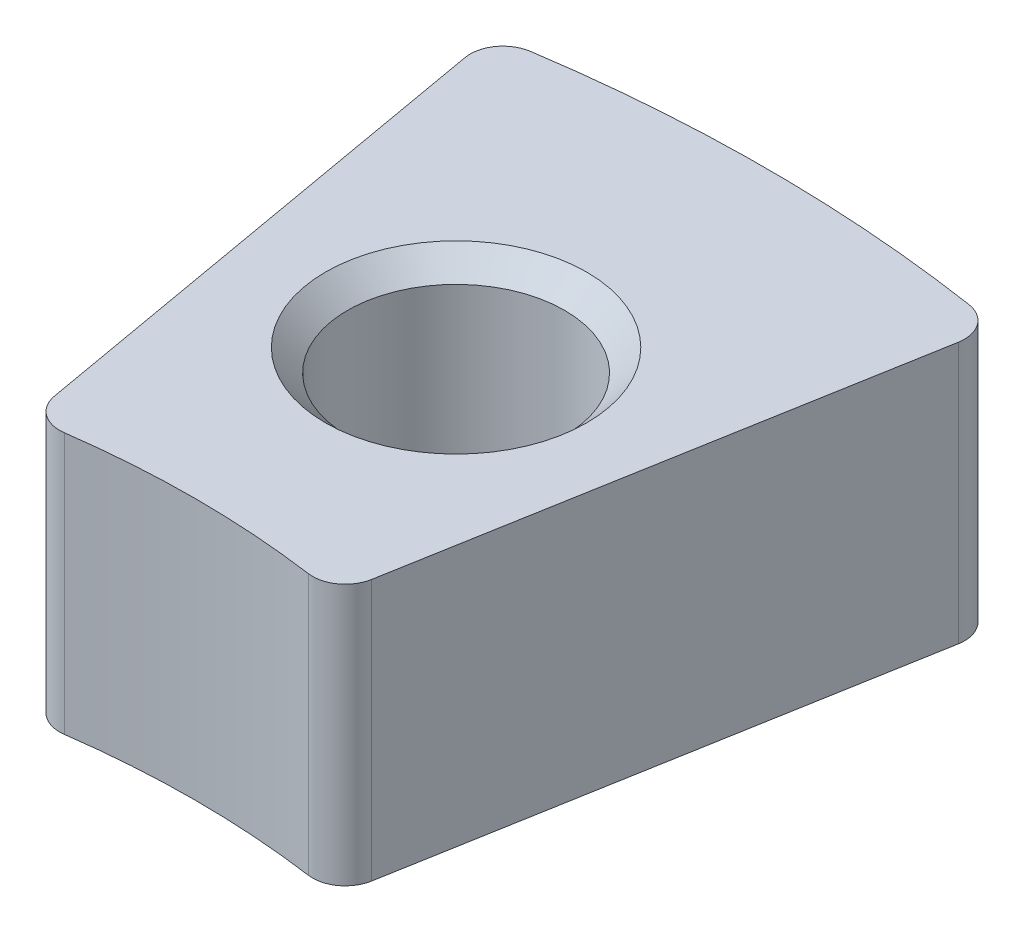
ISO-10303-21;
HEADER;
FILE_DESCRIPTION(('STEP AP214'),'2;1');
FILE_NAME('part.step','',(''),(''),'','','');
FILE_SCHEMA(('AUTOMOTIVE_DESIGN { 1 0 10303 214 1 1 1 1 }'));
ENDSEC;
DATA;
#1=APPLICATION_CONTEXT('core data for automotive mechanical design processes');
#2=APPLICATION_PROTOCOL_DEFINITION('international standard','automotive_design',2000,#1);
#3=PRODUCT_CONTEXT('',#1,'mechanical');
#4=PRODUCT('Part','Part','',(#3));
#5=PRODUCT_RELATED_PRODUCT_CATEGORY('part','',(#4));
#6=PRODUCT_DEFINITION_FORMATION('','',#4);
#7=PRODUCT_DEFINITION_CONTEXT('part definition',#1,'design');
#8=PRODUCT_DEFINITION('design','',#6,#7);
#9=PRODUCT_DEFINITION_SHAPE('','',#8);
#10=(LENGTH_UNIT() NAMED_UNIT(*) SI_UNIT(.MILLI.,.METRE.));
#11=(NAMED_UNIT(*) PLANE_ANGLE_UNIT() SI_UNIT($,.RADIAN.));
#12=(NAMED_UNIT(*) SI_UNIT($,.STERADIAN.) SOLID_ANGLE_UNIT());
#13=UNCERTAINTY_MEASURE_WITH_UNIT(LENGTH_MEASURE(1.E-05),#10,'distance_accuracy_value','');
#14=(GEOMETRIC_REPRESENTATION_CONTEXT(3) GLOBAL_UNCERTAINTY_ASSIGNED_CONTEXT((#13)) GLOBAL_UNIT_ASSIGNED_CONTEXT((#10,
#11,#12)) REPRESENTATION_CONTEXT('',''));
#15=CARTESIAN_POINT('',(0.,0.,0.));
#16=DIRECTION('',(0.,0.,1.));
#17=DIRECTION('',(1.,0.,0.));
#18=AXIS2_PLACEMENT_3D('',#15,#16,#17);
#19=CARTESIAN_POINT('',(0.,8.,34.9999999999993));
#20=DIRECTION('',(0.,1.,0.));
#21=DIRECTION('',(0.,0.,1.));
#22=AXIS2_PLACEMENT_3D('',#19,#20,#21);
#23=PLANE('',#22);
#24=CARTESIAN_POINT('',(0.,8.,34.9999999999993));
#25=DIRECTION('',(0.,1.,0.));
#26=DIRECTION('',(0.,0.,1.));
#27=AXIS2_PLACEMENT_3D('',#24,#25,#26);
#28=CIRCLE('',#27,44.4999999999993);
#29=CARTESIAN_POINT('',(6.7178547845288,8.,-8.9900037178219));
#30=VERTEX_POINT('',#29);
#31=CARTESIAN_POINT('',(-6.7178547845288,8.,-8.9900037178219));
#32=VERTEX_POINT('',#31);
#33=EDGE_CURVE('E143',#30,#32,#28,.T.);
#34=ORIENTED_EDGE('',*,*,#33,.T.);
#35=CARTESIAN_POINT('',(-6.56689175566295,8.,-8.00146430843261));
#36=DIRECTION('',(0.,1.,0.));
#37=DIRECTION('',(0.,0.,1.));
#38=AXIS2_PLACEMENT_3D('',#35,#36,#37);
#39=CIRCLE('',#38,1.00000000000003);
#40=CARTESIAN_POINT('',(-7.5516995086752,8.,-7.8278161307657));
#41=VERTEX_POINT('',#40);
#42=EDGE_CURVE('E91',#32,#41,#39,.T.);
#43=ORIENTED_EDGE('',*,*,#42,.T.);
#44=DIRECTION('',(0.173648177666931,0.,0.984807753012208));
#45=VECTOR('',#44,1.);
#46=CARTESIAN_POINT('',(-7.5516995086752,8.,-7.8278161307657));
#47=LINE('',#46,#45);
#48=CARTESIAN_POINT('',(-4.8590471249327,8.,7.4429743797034));
#49=VERTEX_POINT('',#48);
#50=EDGE_CURVE('E158',#41,#49,#47,.T.);
#51=ORIENTED_EDGE('',*,*,#50,.T.);
#52=CARTESIAN_POINT('',(-3.87423937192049,8.,7.26932620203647));
#53=DIRECTION('',(0.,1.,0.));
#54=DIRECTION('',(0.,0.,1.));
#55=AXIS2_PLACEMENT_3D('',#52,#53,#54);
#56=CIRCLE('',#55,1.);
#57=CARTESIAN_POINT('',(-3.7358736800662,8.,8.2597074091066));
#58=VERTEX_POINT('',#57);
#59=EDGE_CURVE('E171',#49,#58,#56,.T.);
#60=ORIENTED_EDGE('',*,*,#59,.T.);
#61=CARTESIAN_POINT('',(0.,8.,34.9999999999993));
#62=DIRECTION('',(0.,-1.,0.));
#63=DIRECTION('',(0.,0.,-1.));
#64=AXIS2_PLACEMENT_3D('',#61,#62,#63);
#65=CIRCLE('',#64,26.9999999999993);
#66=CARTESIAN_POINT('',(3.7358736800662,8.,8.2597074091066));
#67=VERTEX_POINT('',#66);
#68=EDGE_CURVE('E110',#58,#67,#65,.T.);
#69=ORIENTED_EDGE('',*,*,#68,.T.);
#70=CARTESIAN_POINT('',(3.87423937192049,8.,7.26932620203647));
#71=DIRECTION('',(0.,1.,0.));
#72=DIRECTION('',(0.,0.,1.));
#73=AXIS2_PLACEMENT_3D('',#70,#71,#72);
#74=CIRCLE('',#73,1.);
#75=CARTESIAN_POINT('',(4.8590471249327,8.,7.4429743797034));
#76=VERTEX_POINT('',#75);
#77=EDGE_CURVE('E104',#67,#76,#74,.T.);
#78=ORIENTED_EDGE('',*,*,#77,.T.);
#79=DIRECTION('',(0.173648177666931,0.,-0.984807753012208));
#80=VECTOR('',#79,1.);
#81=CARTESIAN_POINT('',(4.8590471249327,8.,7.4429743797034));
#82=LINE('',#81,#80);
#83=CARTESIAN_POINT('',(7.5516995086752,8.,-7.8278161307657));
#84=VERTEX_POINT('',#83);
#85=EDGE_CURVE('E108',#76,#84,#82,.T.);
#86=ORIENTED_EDGE('',*,*,#85,.T.);
#87=CARTESIAN_POINT('',(6.56689175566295,8.,-8.00146430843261));
#88=DIRECTION('',(0.,1.,0.));
#89=DIRECTION('',(0.,0.,1.));
#90=AXIS2_PLACEMENT_3D('',#87,#88,#89);
#91=CIRCLE('',#90,1.00000000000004);
#92=EDGE_CURVE('E48',#84,#30,#91,.T.);
#93=ORIENTED_EDGE('',*,*,#92,.T.);
#94=EDGE_LOOP('',(#34,#43,#51,#60,#69,#78,#86,#93));
#95=FACE_BOUND('',#94,.T.);
#96=CARTESIAN_POINT('',(0.,8.,0.));
#97=DIRECTION('',(0.,1.,0.));
#98=DIRECTION('',(0.,0.,1.));
#99=AXIS2_PLACEMENT_3D('',#96,#97,#98);
#100=CIRCLE('',#99,4.);
#101=CARTESIAN_POINT('',(0.,8.,4.));
#102=VERTEX_POINT('',#101);
#103=EDGE_CURVE('E132',#102,#102,#100,.T.);
#104=ORIENTED_EDGE('',*,*,#103,.F.);
#105=EDGE_LOOP('',(#104));
#106=FACE_BOUND('',#105,.T.);
#107=ADVANCED_FACE('F31',(#95,#106),#23,.T.);
#108=CARTESIAN_POINT('',(0.,0.,34.9999999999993));
#109=DIRECTION('',(0.,1.,0.));
#110=DIRECTION('',(0.,0.,1.));
#111=AXIS2_PLACEMENT_3D('',#108,#109,#110);
#112=PLANE('',#111);
#113=CARTESIAN_POINT('',(0.,0.,34.9999999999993));
#114=DIRECTION('',(0.,1.,0.));
#115=DIRECTION('',(0.,0.,1.));
#116=AXIS2_PLACEMENT_3D('',#113,#114,#115);
#117=CIRCLE('',#116,44.4999999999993);
#118=CARTESIAN_POINT('',(6.7178547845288,0.,-8.9900037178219));
#119=VERTEX_POINT('',#118);
#120=CARTESIAN_POINT('',(-6.7178547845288,0.,-8.9900037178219));
#121=VERTEX_POINT('',#120);
#122=EDGE_CURVE('E128',#119,#121,#117,.T.);
#123=ORIENTED_EDGE('',*,*,#122,.F.);
#124=CARTESIAN_POINT('',(6.56689175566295,0.,-8.00146430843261));
#125=DIRECTION('',(0.,1.,0.));
#126=DIRECTION('',(0.,0.,1.));
#127=AXIS2_PLACEMENT_3D('',#124,#125,#126);
#128=CIRCLE('',#127,1.00000000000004);
#129=CARTESIAN_POINT('',(7.5516995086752,0.,-7.8278161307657));
#130=VERTEX_POINT('',#129);
#131=EDGE_CURVE('E83',#130,#119,#128,.T.);
#132=ORIENTED_EDGE('',*,*,#131,.F.);
#133=DIRECTION('',(0.173648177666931,0.,-0.984807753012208));
#134=VECTOR('',#133,1.);
#135=CARTESIAN_POINT('',(4.8590471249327,0.,7.4429743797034));
#136=LINE('',#135,#134);
#137=CARTESIAN_POINT('',(4.8590471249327,0.,7.4429743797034));
#138=VERTEX_POINT('',#137);
#139=EDGE_CURVE('E77',#138,#130,#136,.T.);
#140=ORIENTED_EDGE('',*,*,#139,.F.);
#141=CARTESIAN_POINT('',(3.87423937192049,0.,7.26932620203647));
#142=DIRECTION('',(0.,1.,0.));
#143=DIRECTION('',(0.,0.,1.));
#144=AXIS2_PLACEMENT_3D('',#141,#142,#143);
#145=CIRCLE('',#144,1.);
#146=CARTESIAN_POINT('',(3.7358736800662,0.,8.2597074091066));
#147=VERTEX_POINT('',#146);
#148=EDGE_CURVE('E118',#147,#138,#145,.T.);
#149=ORIENTED_EDGE('',*,*,#148,.F.);
#150=CARTESIAN_POINT('',(0.,0.,34.9999999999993));
#151=DIRECTION('',(0.,-1.,0.));
#152=DIRECTION('',(0.,0.,-1.));
#153=AXIS2_PLACEMENT_3D('',#150,#151,#152);
#154=CIRCLE('',#153,26.9999999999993);
#155=CARTESIAN_POINT('',(-3.7358736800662,0.,8.2597074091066));
#156=VERTEX_POINT('',#155);
#157=EDGE_CURVE('E138',#156,#147,#154,.T.);
#158=ORIENTED_EDGE('',*,*,#157,.F.);
#159=CARTESIAN_POINT('',(-3.87423937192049,0.,7.26932620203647));
#160=DIRECTION('',(0.,1.,0.));
#161=DIRECTION('',(0.,0.,1.));
#162=AXIS2_PLACEMENT_3D('',#159,#160,#161);
#163=CIRCLE('',#162,1.);
#164=CARTESIAN_POINT('',(-4.8590471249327,0.,7.4429743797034));
#165=VERTEX_POINT('',#164);
#166=EDGE_CURVE('E136',#165,#156,#163,.T.);
#167=ORIENTED_EDGE('',*,*,#166,.F.);
#168=DIRECTION('',(0.173648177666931,0.,0.984807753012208));
#169=VECTOR('',#168,1.);
#170=CARTESIAN_POINT('',(-7.5516995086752,0.,-7.8278161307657));
#171=LINE('',#170,#169);
#172=CARTESIAN_POINT('',(-7.5516995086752,0.,-7.8278161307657));
#173=VERTEX_POINT('',#172);
#174=EDGE_CURVE('E134',#173,#165,#171,.T.);
#175=ORIENTED_EDGE('',*,*,#174,.F.);
#176=CARTESIAN_POINT('',(-6.56689175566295,0.,-8.00146430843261));
#177=DIRECTION('',(0.,1.,0.));
#178=DIRECTION('',(0.,0.,1.));
#179=AXIS2_PLACEMENT_3D('',#176,#177,#178);
#180=CIRCLE('',#179,1.00000000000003);
#181=EDGE_CURVE('E131',#121,#173,#180,.T.);
#182=ORIENTED_EDGE('',*,*,#181,.F.);
#183=EDGE_LOOP('',(#123,#132,#140,#149,#158,#167,#175,#182));
#184=FACE_BOUND('',#183,.T.);
#185=CARTESIAN_POINT('',(0.,0.,0.));
#186=DIRECTION('',(0.,1.,0.));
#187=DIRECTION('',(0.,0.,1.));
#188=AXIS2_PLACEMENT_3D('',#185,#186,#187);
#189=CIRCLE('',#188,4.);
#190=CARTESIAN_POINT('',(0.,0.,4.));
#191=VERTEX_POINT('',#190);
#192=EDGE_CURVE('E185',#191,#191,#189,.T.);
#193=ORIENTED_EDGE('',*,*,#192,.T.);
#194=EDGE_LOOP('',(#193));
#195=FACE_BOUND('',#194,.T.);
#196=ADVANCED_FACE('F162',(#184,#195),#112,.F.);
#197=CARTESIAN_POINT('',(0.,8.,34.9999999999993));
#198=DIRECTION('',(0.,-1.,0.));
#199=DIRECTION('',(0.,0.,-1.));
#200=AXIS2_PLACEMENT_3D('',#197,#198,#199);
#201=CYLINDRICAL_SURFACE('',#200,44.4999999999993);
#202=ORIENTED_EDGE('',*,*,#122,.T.);
#203=DIRECTION('',(0.,-1.,0.));
#204=VECTOR('',#203,1.);
#205=CARTESIAN_POINT('',(-6.7178547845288,8.,-8.9900037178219));
#206=LINE('',#205,#204);
#207=EDGE_CURVE('E11',#32,#121,#206,.T.);
#208=ORIENTED_EDGE('',*,*,#207,.F.);
#209=ORIENTED_EDGE('',*,*,#33,.F.);
#210=DIRECTION('',(0.,-1.,0.));
#211=VECTOR('',#210,1.);
#212=CARTESIAN_POINT('',(6.7178547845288,8.,-8.9900037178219));
#213=LINE('',#212,#211);
#214=EDGE_CURVE('E124',#30,#119,#213,.T.);
#215=ORIENTED_EDGE('',*,*,#214,.T.);
#216=EDGE_LOOP('',(#202,#208,#209,#215));
#217=FACE_BOUND('',#216,.T.);
#218=ADVANCED_FACE('F33',(#217),#201,.T.);
#219=CARTESIAN_POINT('',(-6.56689175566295,8.,-8.00146430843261));
#220=DIRECTION('',(0.,-1.,0.));
#221=DIRECTION('',(0.,0.,-1.));
#222=AXIS2_PLACEMENT_3D('',#219,#220,#221);
#223=CYLINDRICAL_SURFACE('',#222,1.00000000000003);
#224=ORIENTED_EDGE('',*,*,#181,.T.);
#225=DIRECTION('',(0.,-1.,0.));
#226=VECTOR('',#225,1.);
#227=CARTESIAN_POINT('',(-7.5516995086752,8.,-7.8278161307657));
#228=LINE('',#227,#226);
#229=EDGE_CURVE('E40',#41,#173,#228,.T.);
#230=ORIENTED_EDGE('',*,*,#229,.F.);
#231=ORIENTED_EDGE('',*,*,#42,.F.);
#232=ORIENTED_EDGE('',*,*,#207,.T.);
#233=EDGE_LOOP('',(#224,#230,#231,#232));
#234=FACE_BOUND('',#233,.T.);
#235=ADVANCED_FACE('F220',(#234),#223,.T.);
#236=CARTESIAN_POINT('',(-7.5516995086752,8.,-7.8278161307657));
#237=DIRECTION('',(0.984807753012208,0.,-0.173648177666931));
#238=DIRECTION('',(-0.173648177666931,0.,-0.984807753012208));
#239=AXIS2_PLACEMENT_3D('',#236,#237,#238);
#240=PLANE('',#239);
#241=ORIENTED_EDGE('',*,*,#174,.T.);
#242=DIRECTION('',(0.,-1.,0.));
#243=VECTOR('',#242,1.);
#244=CARTESIAN_POINT('',(-4.8590471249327,8.,7.4429743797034));
#245=LINE('',#244,#243);
#246=EDGE_CURVE('E150',#49,#165,#245,.T.);
#247=ORIENTED_EDGE('',*,*,#246,.F.);
#248=ORIENTED_EDGE('',*,*,#50,.F.);
#249=ORIENTED_EDGE('',*,*,#229,.T.);
#250=EDGE_LOOP('',(#241,#247,#248,#249));
#251=FACE_BOUND('',#250,.T.);
#252=ADVANCED_FACE('F156',(#251),#240,.F.);
#253=CARTESIAN_POINT('',(-3.87423937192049,8.,7.26932620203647));
#254=DIRECTION('',(0.,-1.,0.));
#255=DIRECTION('',(0.,0.,-1.));
#256=AXIS2_PLACEMENT_3D('',#253,#254,#255);
#257=CYLINDRICAL_SURFACE('',#256,1.);
#258=ORIENTED_EDGE('',*,*,#166,.T.);
#259=DIRECTION('',(0.,-1.,0.));
#260=VECTOR('',#259,1.);
#261=CARTESIAN_POINT('',(-3.7358736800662,8.,8.2597074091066));
#262=LINE('',#261,#260);
#263=EDGE_CURVE('E147',#58,#156,#262,.T.);
#264=ORIENTED_EDGE('',*,*,#263,.F.);
#265=ORIENTED_EDGE('',*,*,#59,.F.);
#266=ORIENTED_EDGE('',*,*,#246,.T.);
#267=EDGE_LOOP('',(#258,#264,#265,#266));
#268=FACE_BOUND('',#267,.T.);
#269=ADVANCED_FACE('F167',(#268),#257,.T.);
#270=CARTESIAN_POINT('',(0.,8.,34.9999999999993));
#271=DIRECTION('',(0.,-1.,0.));
#272=DIRECTION('',(0.,0.,-1.));
#273=AXIS2_PLACEMENT_3D('',#270,#271,#272);
#274=CYLINDRICAL_SURFACE('',#273,26.9999999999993);
#275=ORIENTED_EDGE('',*,*,#157,.T.);
#276=DIRECTION('',(0.,-1.,0.));
#277=VECTOR('',#276,1.);
#278=CARTESIAN_POINT('',(3.7358736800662,8.,8.2597074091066));
#279=LINE('',#278,#277);
#280=EDGE_CURVE('E119',#67,#147,#279,.T.);
#281=ORIENTED_EDGE('',*,*,#280,.F.);
#282=ORIENTED_EDGE('',*,*,#68,.F.);
#283=ORIENTED_EDGE('',*,*,#263,.T.);
#284=EDGE_LOOP('',(#275,#281,#282,#283));
#285=FACE_BOUND('',#284,.T.);
#286=ADVANCED_FACE('F170',(#285),#274,.F.);
#287=CARTESIAN_POINT('',(3.87423937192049,8.,7.26932620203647));
#288=DIRECTION('',(0.,-1.,0.));
#289=DIRECTION('',(0.,0.,-1.));
#290=AXIS2_PLACEMENT_3D('',#287,#288,#289);
#291=CYLINDRICAL_SURFACE('',#290,1.);
#292=ORIENTED_EDGE('',*,*,#148,.T.);
#293=DIRECTION('',(0.,-1.,0.));
#294=VECTOR('',#293,1.);
#295=CARTESIAN_POINT('',(4.8590471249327,8.,7.4429743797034));
#296=LINE('',#295,#294);
#297=EDGE_CURVE('E115',#76,#138,#296,.T.);
#298=ORIENTED_EDGE('',*,*,#297,.F.);
#299=ORIENTED_EDGE('',*,*,#77,.F.);
#300=ORIENTED_EDGE('',*,*,#280,.T.);
#301=EDGE_LOOP('',(#292,#298,#299,#300));
#302=FACE_BOUND('',#301,.T.);
#303=ADVANCED_FACE('F116',(#302),#291,.T.);
#304=CARTESIAN_POINT('',(4.8590471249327,8.,7.4429743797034));
#305=DIRECTION('',(-0.984807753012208,0.,-0.173648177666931));
#306=DIRECTION('',(-0.173648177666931,0.,0.984807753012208));
#307=AXIS2_PLACEMENT_3D('',#304,#305,#306);
#308=PLANE('',#307);
#309=ORIENTED_EDGE('',*,*,#139,.T.);
#310=DIRECTION('',(0.,-1.,0.));
#311=VECTOR('',#310,1.);
#312=CARTESIAN_POINT('',(7.5516995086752,8.,-7.8278161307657));
#313=LINE('',#312,#311);
#314=EDGE_CURVE('E120',#84,#130,#313,.T.);
#315=ORIENTED_EDGE('',*,*,#314,.F.);
#316=ORIENTED_EDGE('',*,*,#85,.F.);
#317=ORIENTED_EDGE('',*,*,#297,.T.);
#318=EDGE_LOOP('',(#309,#315,#316,#317));
#319=FACE_BOUND('',#318,.T.);
#320=ADVANCED_FACE('F122',(#319),#308,.F.);
#321=CARTESIAN_POINT('',(6.56689175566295,8.,-8.00146430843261));
#322=DIRECTION('',(0.,-1.,0.));
#323=DIRECTION('',(0.,0.,-1.));
#324=AXIS2_PLACEMENT_3D('',#321,#322,#323);
#325=CYLINDRICAL_SURFACE('',#324,1.00000000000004);
#326=ORIENTED_EDGE('',*,*,#131,.T.);
#327=ORIENTED_EDGE('',*,*,#214,.F.);
#328=ORIENTED_EDGE('',*,*,#92,.F.);
#329=ORIENTED_EDGE('',*,*,#314,.T.);
#330=EDGE_LOOP('',(#326,#327,#328,#329));
#331=FACE_BOUND('',#330,.T.);
#332=ADVANCED_FACE('F208',(#331),#325,.T.);
#333=CARTESIAN_POINT('',(0.,7.3235,0.));
#334=DIRECTION('',(0.,1.,0.));
#335=DIRECTION('',(0.,0.,1.));
#336=AXIS2_PLACEMENT_3D('',#333,#334,#335);
#337=CONICAL_SURFACE('',#336,3.3235,0.785398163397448);
#338=ORIENTED_EDGE('',*,*,#103,.T.);
#339=EDGE_LOOP('',(#338));
#340=FACE_BOUND('',#339,.T.);
#341=CARTESIAN_POINT('',(0.,7.3235,0.));
#342=DIRECTION('',(0.,1.,0.));
#343=DIRECTION('',(0.,0.,1.));
#344=AXIS2_PLACEMENT_3D('',#341,#342,#343);
#345=CIRCLE('',#344,3.3235);
#346=CARTESIAN_POINT('',(0.,7.3235,3.3235));
#347=VERTEX_POINT('',#346);
#348=EDGE_CURVE('E179',#347,#347,#345,.T.);
#349=ORIENTED_EDGE('',*,*,#348,.F.);
#350=EDGE_LOOP('',(#349));
#351=FACE_BOUND('',#350,.T.);
#352=ADVANCED_FACE('F197',(#340,#351),#337,.F.);
#353=CARTESIAN_POINT('',(0.,0.,0.));
#354=DIRECTION('',(0.,1.,0.));
#355=DIRECTION('',(0.,0.,1.));
#356=AXIS2_PLACEMENT_3D('',#353,#354,#355);
#357=CYLINDRICAL_SURFACE('',#356,3.3235);
#358=ORIENTED_EDGE('',*,*,#348,.T.);
#359=EDGE_LOOP('',(#358));
#360=FACE_BOUND('',#359,.T.);
#361=CARTESIAN_POINT('',(0.,0.6765,0.));
#362=DIRECTION('',(0.,1.,0.));
#363=DIRECTION('',(0.,0.,1.));
#364=AXIS2_PLACEMENT_3D('',#361,#362,#363);
#365=CIRCLE('',#364,3.3235);
#366=CARTESIAN_POINT('',(0.,0.6765,3.3235));
#367=VERTEX_POINT('',#366);
#368=EDGE_CURVE('E182',#367,#367,#365,.T.);
#369=ORIENTED_EDGE('',*,*,#368,.F.);
#370=EDGE_LOOP('',(#369));
#371=FACE_BOUND('',#370,.T.);
#372=ADVANCED_FACE('F191',(#360,#371),#357,.F.);
#373=CARTESIAN_POINT('',(0.,0.,0.));
#374=DIRECTION('',(0.,-1.,0.));
#375=DIRECTION('',(0.,0.,-1.));
#376=AXIS2_PLACEMENT_3D('',#373,#374,#375);
#377=CONICAL_SURFACE('',#376,4.,0.785398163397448);
#378=ORIENTED_EDGE('',*,*,#368,.T.);
#379=EDGE_LOOP('',(#378));
#380=FACE_BOUND('',#379,.T.);
#381=ORIENTED_EDGE('',*,*,#192,.F.);
#382=EDGE_LOOP('',(#381));
#383=FACE_BOUND('',#382,.T.);
#384=ADVANCED_FACE('F189',(#380,#383),#377,.F.);
#385=CLOSED_SHELL('',(#107,#196,#218,#235,#252,#269,#286,#303,#320,#332,#352,#372,#384));
#386=MANIFOLD_SOLID_BREP('B2',#385);
#387=ADVANCED_BREP_SHAPE_REPRESENTATION('',(#18,#386),#14);
#388=SHAPE_DEFINITION_REPRESENTATION(#9,#387);
ENDSEC;
END-ISO-10303-21;
